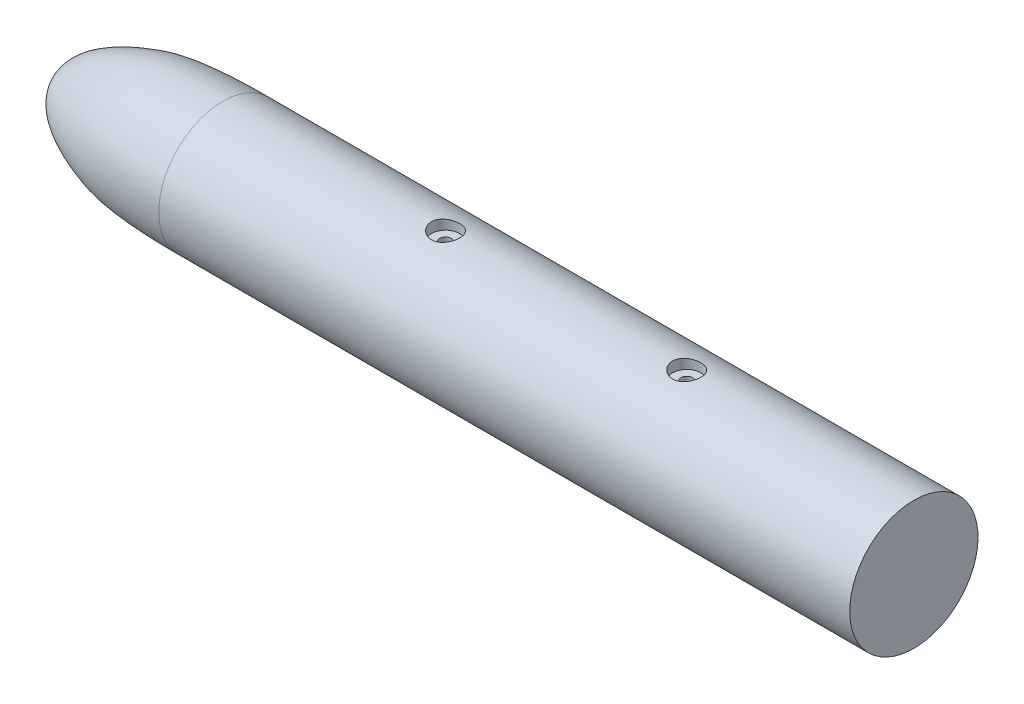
ISO-10303-21;
HEADER;
FILE_DESCRIPTION(('STEP AP214'),'2;1');
FILE_NAME('part.step','',(''),(''),'','','');
FILE_SCHEMA(('AUTOMOTIVE_DESIGN { 1 0 10303 214 1 1 1 1 }'));
ENDSEC;
DATA;
#1=APPLICATION_CONTEXT('core data for automotive mechanical design processes');
#2=APPLICATION_PROTOCOL_DEFINITION('international standard','automotive_design',2000,#1);
#3=PRODUCT_CONTEXT('',#1,'mechanical');
#4=PRODUCT('Part','Part','',(#3));
#5=PRODUCT_RELATED_PRODUCT_CATEGORY('part','',(#4));
#6=PRODUCT_DEFINITION_FORMATION('','',#4);
#7=PRODUCT_DEFINITION_CONTEXT('part definition',#1,'design');
#8=PRODUCT_DEFINITION('design','',#6,#7);
#9=PRODUCT_DEFINITION_SHAPE('','',#8);
#10=(LENGTH_UNIT() NAMED_UNIT(*) SI_UNIT(.MILLI.,.METRE.));
#11=(NAMED_UNIT(*) PLANE_ANGLE_UNIT() SI_UNIT($,.RADIAN.));
#12=(NAMED_UNIT(*) SI_UNIT($,.STERADIAN.) SOLID_ANGLE_UNIT());
#13=UNCERTAINTY_MEASURE_WITH_UNIT(LENGTH_MEASURE(1.E-05),#10,'distance_accuracy_value','');
#14=(GEOMETRIC_REPRESENTATION_CONTEXT(3) GLOBAL_UNCERTAINTY_ASSIGNED_CONTEXT((#13)) GLOBAL_UNIT_ASSIGNED_CONTEXT((#10,
#11,#12)) REPRESENTATION_CONTEXT('',''));
#15=CARTESIAN_POINT('',(0.,0.,0.));
#16=DIRECTION('',(0.,0.,1.));
#17=DIRECTION('',(1.,0.,0.));
#18=AXIS2_PLACEMENT_3D('',#15,#16,#17);
#19=CARTESIAN_POINT('',(164.275013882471,124.14471887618,0.));
#20=CARTESIAN_POINT('',(136.095574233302,124.14471887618,0.));
#21=CARTESIAN_POINT('',(107.837991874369,122.226315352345,0.));
#22=CARTESIAN_POINT('',(74.8345097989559,112.405956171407,0.));
#23=CARTESIAN_POINT('',(37.8142107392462,98.4388174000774,0.));
#24=CARTESIAN_POINT('',(37.8142107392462,74.1447188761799,0.));
#25=B_SPLINE_CURVE_WITH_KNOTS('',3,(#19,#20,#21,#22,#23,#24),.UNSPECIFIED.,.F.,.F.,(4,1,1,4),
(0.,0.389084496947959,0.472741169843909,1.),.UNSPECIFIED.);
#26=CARTESIAN_POINT('',(702.814210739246,74.14471887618,0.));
#27=DIRECTION('',(1.,0.,0.));
#28=AXIS1_PLACEMENT('',#26,#27);
#29=SURFACE_OF_REVOLUTION('',#25,#28);
#30=CARTESIAN_POINT('',(37.8142107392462,74.1447188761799,0.));
#31=VERTEX_POINT('',#30);
#32=VERTEX_LOOP('',#31);
#33=FACE_BOUND('',#32,.T.);
#34=CARTESIAN_POINT('',(164.275013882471,74.1447188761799,0.));
#35=DIRECTION('',(1.,0.,0.));
#36=DIRECTION('',(0.,1.,0.));
#37=AXIS2_PLACEMENT_3D('',#34,#35,#36);
#38=CIRCLE('',#37,50.);
#39=CARTESIAN_POINT('',(164.275013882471,124.14471887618,0.));
#40=VERTEX_POINT('',#39);
#41=EDGE_CURVE('E53',#40,#40,#38,.T.);
#42=ORIENTED_EDGE('',*,*,#41,.F.);
#43=EDGE_LOOP('',(#42));
#44=FACE_BOUND('',#43,.T.);
#45=ADVANCED_FACE('F35',(#33,#44),#29,.F.);
#46=CARTESIAN_POINT('',(702.814210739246,74.14471887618,0.));
#47=DIRECTION('',(1.,0.,0.));
#48=DIRECTION('',(0.,1.,0.));
#49=AXIS2_PLACEMENT_3D('',#46,#47,#48);
#50=CYLINDRICAL_SURFACE('',#49,50.);
#51=CARTESIAN_POINT('',(337.814210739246,24.710419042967,-7.50000000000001));
#52=CARTESIAN_POINT('',(338.023647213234,24.7104202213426,-7.50000285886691));
#53=CARTESIAN_POINT('',(338.233043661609,24.7090854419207,-7.49122436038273));
#54=CARTESIAN_POINT('',(338.650400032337,24.7037874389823,-7.45618073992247));
#55=CARTESIAN_POINT('',(338.858359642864,24.6998236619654,-7.42991193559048));
#56=CARTESIAN_POINT('',(339.271425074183,24.6893773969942,-7.36005702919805));
#57=CARTESIAN_POINT('',(339.476528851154,24.6828931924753,-7.31645912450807));
#58=CARTESIAN_POINT('',(339.882361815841,24.6675916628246,-7.21225725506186));
#59=CARTESIAN_POINT('',(340.083089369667,24.658773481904,-7.15164705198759));
#60=CARTESIAN_POINT('',(340.478449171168,24.6390704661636,-7.01395763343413));
#61=CARTESIAN_POINT('',(340.673088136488,24.6281880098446,-6.93689735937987));
#62=CARTESIAN_POINT('',(341.055228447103,24.6046562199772,-6.76679848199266));
#63=CARTESIAN_POINT('',(341.242727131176,24.5920062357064,-6.67375399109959));
#64=CARTESIAN_POINT('',(341.609123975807,24.5653078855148,-6.47242661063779));
#65=CARTESIAN_POINT('',(341.788026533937,24.5512602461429,-6.36415162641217));
#66=CARTESIAN_POINT('',(342.13617795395,24.522150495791,-6.13304743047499));
#67=CARTESIAN_POINT('',(342.305423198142,24.507088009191,-6.01021281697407));
#68=CARTESIAN_POINT('',(342.634151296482,24.4762695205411,-5.74999260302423));
#69=CARTESIAN_POINT('',(342.793560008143,24.460509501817,-5.61251380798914));
#70=CARTESIAN_POINT('',(343.100311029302,24.4288303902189,-5.32460397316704));
#71=CARTESIAN_POINT('',(343.24764885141,24.412911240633,-5.17416815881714));
#72=CARTESIAN_POINT('',(343.529128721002,24.3813716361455,-4.86147613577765));
#73=CARTESIAN_POINT('',(343.663274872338,24.3657510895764,-4.69922363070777));
#74=CARTESIAN_POINT('',(343.917533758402,24.3352357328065,-4.36391276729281));
#75=CARTESIAN_POINT('',(344.037641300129,24.3203411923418,-4.19085044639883));
#76=CARTESIAN_POINT('',(344.2634376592,24.2916354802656,-3.83434446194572));
#77=CARTESIAN_POINT('',(344.369057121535,24.2778296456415,-3.65085643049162));
#78=CARTESIAN_POINT('',(344.564450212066,24.251769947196,-3.27551999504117));
#79=CARTESIAN_POINT('',(344.654223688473,24.2395160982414,-3.08367151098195));
#80=CARTESIAN_POINT('',(344.817255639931,24.2169098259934,-2.69298404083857));
#81=CARTESIAN_POINT('',(344.890515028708,24.2065572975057,-2.49414544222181));
#82=CARTESIAN_POINT('',(345.019975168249,24.1880483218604,-2.09088597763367));
#83=CARTESIAN_POINT('',(345.07617565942,24.1798919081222,-1.88646502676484));
#84=CARTESIAN_POINT('',(345.170721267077,24.1660626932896,-1.47510875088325));
#85=CARTESIAN_POINT('',(345.209200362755,24.1603712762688,-1.26820484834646));
#86=CARTESIAN_POINT('',(345.268655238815,24.1515405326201,-0.851773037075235));
#87=CARTESIAN_POINT('',(345.289624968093,24.1484020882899,-0.642244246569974));
#88=CARTESIAN_POINT('',(345.31386619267,24.1447721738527,-0.222213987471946));
#89=CARTESIAN_POINT('',(345.317144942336,24.1442796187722,-0.0117129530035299));
#90=CARTESIAN_POINT('',(345.30601883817,24.1459466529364,0.408831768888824));
#91=CARTESIAN_POINT('',(345.291607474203,24.1481072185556,0.61887525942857));
#92=CARTESIAN_POINT('',(345.22229585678,24.1584490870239,1.24250876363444));
#93=CARTESIAN_POINT('',(345.14153536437,24.1704588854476,1.65347650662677));
#94=CARTESIAN_POINT('',(344.91305722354,24.2034424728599,2.45573109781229));
#95=CARTESIAN_POINT('',(344.765337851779,24.2244164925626,2.8470174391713));
#96=CARTESIAN_POINT('',(344.406555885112,24.2731095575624,3.60080086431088));
#97=CARTESIAN_POINT('',(344.195255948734,24.3008538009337,3.96318352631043));
#98=CARTESIAN_POINT('',(343.715484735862,24.3599968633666,4.64754437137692));
#99=CARTESIAN_POINT('',(343.44700969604,24.3913959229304,4.96951989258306));
#100=CARTESIAN_POINT('',(342.85736850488,24.4547109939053,5.56727109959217));
#101=CARTESIAN_POINT('',(342.535710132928,24.4866290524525,5.84256129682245));
#102=CARTESIAN_POINT('',(341.850505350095,24.5470836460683,6.33533031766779));
#103=CARTESIAN_POINT('',(341.486958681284,24.5756201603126,6.5528087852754));
#104=CARTESIAN_POINT('',(340.727790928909,24.6260801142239,6.92384813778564));
#105=CARTESIAN_POINT('',(340.332145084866,24.6479983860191,7.07735910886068));
#106=CARTESIAN_POINT('',(339.520284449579,24.6826487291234,7.31561681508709));
#107=CARTESIAN_POINT('',(339.104071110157,24.6953814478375,7.40036839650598));
#108=CARTESIAN_POINT('',(338.267210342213,24.7100963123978,7.49803607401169));
#109=CARTESIAN_POINT('',(337.846644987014,24.7121814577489,7.51164044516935));
#110=CARTESIAN_POINT('',(337.009239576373,24.7056384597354,7.46845256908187));
#111=CARTESIAN_POINT('',(336.592399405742,24.6970106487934,7.41166250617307));
#112=CARTESIAN_POINT('',(335.776412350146,24.6701088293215,7.22988620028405));
#113=CARTESIAN_POINT('',(335.377187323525,24.6518833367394,7.10524284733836));
#114=CARTESIAN_POINT('',(334.605287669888,24.6078785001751,6.79163767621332));
#115=CARTESIAN_POINT('',(334.232614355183,24.5820987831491,6.60267268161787));
#116=CARTESIAN_POINT('',(333.521354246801,24.5256521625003,6.16419864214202));
#117=CARTESIAN_POINT('',(333.18304523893,24.4949499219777,5.9142444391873));
#118=CARTESIAN_POINT('',(332.552809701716,24.4322068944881,5.36126562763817));
#119=CARTESIAN_POINT('',(332.26088579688,24.4001660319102,5.05823801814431));
#120=CARTESIAN_POINT('',(331.863005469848,24.3536631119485,4.5692491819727));
#121=CARTESIAN_POINT('',(331.736553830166,24.338354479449,4.39964273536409));
#122=CARTESIAN_POINT('',(331.498395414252,24.3087320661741,4.05031856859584));
#123=CARTESIAN_POINT('',(331.38668321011,24.294417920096,3.87060460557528));
#124=CARTESIAN_POINT('',(331.17877350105,24.2671849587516,3.50224772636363));
#125=CARTESIAN_POINT('',(331.082581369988,24.2542666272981,3.31360174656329));
#126=CARTESIAN_POINT('',(330.906480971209,24.2302007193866,2.92882425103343));
#127=CARTESIAN_POINT('',(330.826566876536,24.2190525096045,2.73269544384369));
#128=CARTESIAN_POINT('',(330.683830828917,24.1988748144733,2.33498699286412));
#129=CARTESIAN_POINT('',(330.620949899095,24.1898380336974,2.13342888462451));
#130=CARTESIAN_POINT('',(330.512385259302,24.1740898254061,1.72564776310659));
#131=CARTESIAN_POINT('',(330.466701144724,24.1673783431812,1.51942485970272));
#132=CARTESIAN_POINT('',(330.392879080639,24.1564719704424,1.10380369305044));
#133=CARTESIAN_POINT('',(330.364740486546,24.1522769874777,0.894405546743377));
#134=CARTESIAN_POINT('',(330.326224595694,24.1465231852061,0.473949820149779));
#135=CARTESIAN_POINT('',(330.31584689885,24.1449643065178,0.262892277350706));
#136=CARTESIAN_POINT('',(330.312946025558,24.1445291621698,-0.157311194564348));
#137=CARTESIAN_POINT('',(330.320251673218,24.1456271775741,-0.366455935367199));
#138=CARTESIAN_POINT('',(330.352299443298,24.1504205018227,-0.783301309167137));
#139=CARTESIAN_POINT('',(330.377035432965,24.154114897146,-0.991002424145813));
#140=CARTESIAN_POINT('',(330.443755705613,24.1639973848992,-1.40359226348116));
#141=CARTESIAN_POINT('',(330.485743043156,24.1701859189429,-1.60848048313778));
#142=CARTESIAN_POINT('',(330.586649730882,24.1848835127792,-2.01395355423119));
#143=CARTESIAN_POINT('',(330.645568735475,24.1933925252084,-2.21453849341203));
#144=CARTESIAN_POINT('',(330.779853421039,24.2124870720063,-2.60985890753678));
#145=CARTESIAN_POINT('',(330.855207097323,24.2230710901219,-2.80459853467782));
#146=CARTESIAN_POINT('',(331.021836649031,24.2460261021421,-3.18702983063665));
#147=CARTESIAN_POINT('',(331.113112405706,24.2583970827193,-3.37472155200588));
#148=CARTESIAN_POINT('',(331.310953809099,24.2845871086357,-3.74180864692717));
#149=CARTESIAN_POINT('',(331.417522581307,24.2984064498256,-3.92120231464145));
#150=CARTESIAN_POINT('',(331.645145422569,24.3271052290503,-4.27036894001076));
#151=CARTESIAN_POINT('',(331.766194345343,24.341984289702,-4.44014528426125));
#152=CARTESIAN_POINT('',(332.023215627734,24.3725460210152,-4.77059902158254));
#153=CARTESIAN_POINT('',(332.159321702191,24.388235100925,-4.93117183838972));
#154=CARTESIAN_POINT('',(332.444479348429,24.4198362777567,-5.2402461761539));
#155=CARTESIAN_POINT('',(332.593526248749,24.4357482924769,-5.38875201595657));
#156=CARTESIAN_POINT('',(332.903672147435,24.4673640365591,-5.67281744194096));
#157=CARTESIAN_POINT('',(333.064778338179,24.4830676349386,-5.80836919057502));
#158=CARTESIAN_POINT('',(333.397791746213,24.5138083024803,-6.0654325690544));
#159=CARTESIAN_POINT('',(333.569694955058,24.5288456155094,-6.18694936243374));
#160=CARTESIAN_POINT('',(333.924234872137,24.557921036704,-6.41582997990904));
#161=CARTESIAN_POINT('',(334.106929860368,24.5719525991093,-6.52310439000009));
#162=CARTESIAN_POINT('',(334.480754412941,24.5985062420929,-6.7218199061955));
#163=CARTESIAN_POINT('',(334.671880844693,24.611028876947,-6.81326683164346));
#164=CARTESIAN_POINT('',(335.061143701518,24.634198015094,-6.97964058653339));
#165=CARTESIAN_POINT('',(335.259274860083,24.6448458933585,-7.05457953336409));
#166=CARTESIAN_POINT('',(335.661194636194,24.6639633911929,-7.18744237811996));
#167=CARTESIAN_POINT('',(335.864981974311,24.6724334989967,-7.24537009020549));
#168=CARTESIAN_POINT('',(336.3559754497,24.68973476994,-7.36270195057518));
#169=CARTESIAN_POINT('',(336.64516447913,24.6974555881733,-7.41413110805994));
#170=CARTESIAN_POINT('',(337.227665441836,24.7077968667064,-7.48277790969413));
#171=CARTESIAN_POINT('',(337.520977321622,24.7104173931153,-7.4999959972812));
#172=CARTESIAN_POINT('',(337.814210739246,24.710419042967,-7.50000000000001));
#173=B_SPLINE_CURVE_WITH_KNOTS('',3,(#51,#52,#53,#54,#55,#56,#57,#58,#59,#60,#61,#62,#63,#64,
#65,#66,#67,#68,#69,#70,#71,#72,#73,#74,#75,#76,#77,#78,#79,#80,#81,#82,#83,#84,#85,#86,#87,#88,
#89,#90,#91,#92,#93,#94,#95,#96,#97,#98,#99,#100,#101,#102,#103,#104,#105,#106,#107,#108,#109,
#110,#111,#112,#113,#114,#115,#116,#117,#118,#119,#120,#121,#122,#123,#124,#125,#126,#127,#128,
#129,#130,#131,#132,#133,#134,#135,#136,#137,#138,#139,#140,#141,#142,#143,#144,#145,#146,#147,
#148,#149,#150,#151,#152,#153,#154,#155,#156,#157,#158,#159,#160,#161,#162,#163,#164,#165,#166,
#167,#168,#169,#170,#171,#172),.UNSPECIFIED.,.T.,.F.,(4,2,2,2,2,2,2,2,2,2,2,2,2,2,2,2,2,2,2,2,2,
2,2,2,2,2,2,2,2,2,2,2,2,2,2,2,2,2,2,2,2,2,2,2,2,2,2,2,2,2,2,2,2,2,2,2,2,2,2,2,4),(0.,
0.628052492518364,1.25623725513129,1.88485060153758,2.51369475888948,3.1418187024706,
3.77017450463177,4.39820535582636,5.02646994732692,5.65900321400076,6.291770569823,
6.92434044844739,7.55714358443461,8.1928774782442,8.82861746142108,9.46432226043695,
10.100036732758,10.7308627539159,11.3619066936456,11.9926918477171,12.6237092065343,
13.874249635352,15.1248222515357,16.3801223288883,17.6355050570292,18.9032337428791,
20.1709702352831,21.4396940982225,22.7083285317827,23.9646672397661,25.220966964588,
26.4709762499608,27.721047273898,28.9805308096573,30.2400855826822,30.8757939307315,
31.5112675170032,32.1469606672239,32.7824258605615,33.4156618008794,34.048882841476,
34.6820806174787,35.3152641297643,35.9423429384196,36.5692012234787,37.196170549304,
37.8231270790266,38.4496271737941,39.0761225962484,39.7027462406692,40.3291478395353,
40.961642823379,41.5939104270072,42.2265581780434,42.8589724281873,43.4951860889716,
44.1311653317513,44.7666761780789,45.4020444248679,46.2813963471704,47.1607368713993),.UNSPECIFIED.);
#174=CARTESIAN_POINT('',(337.814210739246,24.710419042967,-7.50000000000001));
#175=VERTEX_POINT('',#174);
#176=EDGE_CURVE('E11',#175,#175,#173,.T.);
#177=ORIENTED_EDGE('',*,*,#176,.F.);
#178=EDGE_LOOP('',(#177));
#179=FACE_BOUND('',#178,.T.);
#180=CARTESIAN_POINT('',(525.814210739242,24.710419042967,-7.49999999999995));
#181=CARTESIAN_POINT('',(526.023647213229,24.7104202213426,-7.50000285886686));
#182=CARTESIAN_POINT('',(526.233043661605,24.7090854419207,-7.49122436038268));
#183=CARTESIAN_POINT('',(526.650400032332,24.7037874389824,-7.45618073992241));
#184=CARTESIAN_POINT('',(526.85835964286,24.6998236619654,-7.42991193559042));
#185=CARTESIAN_POINT('',(527.271425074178,24.6893773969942,-7.36005702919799));
#186=CARTESIAN_POINT('',(527.476528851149,24.6828931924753,-7.31645912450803));
#187=CARTESIAN_POINT('',(527.882361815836,24.6675916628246,-7.21225725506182));
#188=CARTESIAN_POINT('',(528.083089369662,24.658773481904,-7.15164705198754));
#189=CARTESIAN_POINT('',(528.478449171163,24.6390704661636,-7.01395763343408));
#190=CARTESIAN_POINT('',(528.673088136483,24.6281880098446,-6.93689735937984));
#191=CARTESIAN_POINT('',(529.055228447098,24.6046562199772,-6.76679848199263));
#192=CARTESIAN_POINT('',(529.242727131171,24.5920062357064,-6.67375399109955));
#193=CARTESIAN_POINT('',(529.609123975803,24.5653078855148,-6.47242661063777));
#194=CARTESIAN_POINT('',(529.788026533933,24.551260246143,-6.36415162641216));
#195=CARTESIAN_POINT('',(530.136177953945,24.522150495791,-6.13304743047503));
#196=CARTESIAN_POINT('',(530.305423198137,24.507088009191,-6.01021281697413));
#197=CARTESIAN_POINT('',(530.634151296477,24.4762695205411,-5.74999260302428));
#198=CARTESIAN_POINT('',(530.793560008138,24.460509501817,-5.61251380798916));
#199=CARTESIAN_POINT('',(531.100311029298,24.4288303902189,-5.32460397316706));
#200=CARTESIAN_POINT('',(531.247648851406,24.412911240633,-5.17416815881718));
#201=CARTESIAN_POINT('',(531.529128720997,24.3813716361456,-4.86147613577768));
#202=CARTESIAN_POINT('',(531.663274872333,24.3657510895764,-4.69922363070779));
#203=CARTESIAN_POINT('',(531.917533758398,24.3352357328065,-4.36391276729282));
#204=CARTESIAN_POINT('',(532.037641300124,24.3203411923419,-4.19085044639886));
#205=CARTESIAN_POINT('',(532.263437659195,24.2916354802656,-3.83434446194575));
#206=CARTESIAN_POINT('',(532.369057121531,24.2778296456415,-3.65085643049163));
#207=CARTESIAN_POINT('',(532.564450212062,24.251769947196,-3.27551999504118));
#208=CARTESIAN_POINT('',(532.654223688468,24.2395160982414,-3.08367151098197));
#209=CARTESIAN_POINT('',(532.817255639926,24.2169098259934,-2.69298404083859));
#210=CARTESIAN_POINT('',(532.890515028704,24.2065572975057,-2.49414544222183));
#211=CARTESIAN_POINT('',(533.019975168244,24.1880483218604,-2.09088597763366));
#212=CARTESIAN_POINT('',(533.076175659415,24.1798919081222,-1.88646502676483));
#213=CARTESIAN_POINT('',(533.170721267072,24.1660626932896,-1.47510875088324));
#214=CARTESIAN_POINT('',(533.20920036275,24.1603712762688,-1.26820484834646));
#215=CARTESIAN_POINT('',(533.26865523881,24.1515405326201,-0.851773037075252));
#216=CARTESIAN_POINT('',(533.289624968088,24.1484020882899,-0.64224424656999));
#217=CARTESIAN_POINT('',(533.313866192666,24.1447721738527,-0.222213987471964));
#218=CARTESIAN_POINT('',(533.317144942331,24.1442796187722,-0.0117129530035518));
#219=CARTESIAN_POINT('',(533.306018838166,24.1459466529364,0.408831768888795));
#220=CARTESIAN_POINT('',(533.291607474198,24.1481072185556,0.618875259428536));
#221=CARTESIAN_POINT('',(533.222295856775,24.1584490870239,1.24250876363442));
#222=CARTESIAN_POINT('',(533.141535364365,24.1704588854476,1.65347650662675));
#223=CARTESIAN_POINT('',(532.913057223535,24.2034424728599,2.45573109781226));
#224=CARTESIAN_POINT('',(532.765337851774,24.2244164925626,2.84701743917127));
#225=CARTESIAN_POINT('',(532.406555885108,24.2731095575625,3.60080086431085));
#226=CARTESIAN_POINT('',(532.195255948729,24.3008538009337,3.9631835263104));
#227=CARTESIAN_POINT('',(531.715484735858,24.3599968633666,4.64754437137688));
#228=CARTESIAN_POINT('',(531.447009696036,24.3913959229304,4.969519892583));
#229=CARTESIAN_POINT('',(530.857368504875,24.4547109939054,5.56727109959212));
#230=CARTESIAN_POINT('',(530.535710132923,24.4866290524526,5.84256129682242));
#231=CARTESIAN_POINT('',(529.850505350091,24.5470836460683,6.33533031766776));
#232=CARTESIAN_POINT('',(529.48695868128,24.5756201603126,6.55280878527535));
#233=CARTESIAN_POINT('',(528.727790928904,24.6260801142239,6.92384813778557));
#234=CARTESIAN_POINT('',(528.332145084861,24.6479983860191,7.07735910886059));
#235=CARTESIAN_POINT('',(527.520284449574,24.6826487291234,7.315616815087));
#236=CARTESIAN_POINT('',(527.104071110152,24.6953814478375,7.40036839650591));
#237=CARTESIAN_POINT('',(526.267210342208,24.7100963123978,7.49803607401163));
#238=CARTESIAN_POINT('',(525.84664498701,24.7121814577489,7.5116404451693));
#239=CARTESIAN_POINT('',(525.009239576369,24.7056384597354,7.46845256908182));
#240=CARTESIAN_POINT('',(524.592399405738,24.6970106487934,7.41166250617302));
#241=CARTESIAN_POINT('',(523.776412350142,24.6701088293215,7.22988620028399));
#242=CARTESIAN_POINT('',(523.37718732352,24.6518833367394,7.10524284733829));
#243=CARTESIAN_POINT('',(522.605287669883,24.6078785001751,6.79163767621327));
#244=CARTESIAN_POINT('',(522.232614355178,24.5820987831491,6.60267268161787));
#245=CARTESIAN_POINT('',(521.521354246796,24.5256521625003,6.16419864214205));
#246=CARTESIAN_POINT('',(521.183045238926,24.4949499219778,5.91424443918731));
#247=CARTESIAN_POINT('',(520.552809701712,24.4322068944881,5.36126562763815));
#248=CARTESIAN_POINT('',(520.260885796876,24.4001660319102,5.05823801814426));
#249=CARTESIAN_POINT('',(519.863005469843,24.3536631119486,4.56924918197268));
#250=CARTESIAN_POINT('',(519.736553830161,24.338354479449,4.39964273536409));
#251=CARTESIAN_POINT('',(519.498395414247,24.3087320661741,4.05031856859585));
#252=CARTESIAN_POINT('',(519.386683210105,24.294417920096,3.87060460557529));
#253=CARTESIAN_POINT('',(519.178773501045,24.2671849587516,3.50224772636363));
#254=CARTESIAN_POINT('',(519.082581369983,24.2542666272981,3.31360174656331));
#255=CARTESIAN_POINT('',(518.906480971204,24.2302007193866,2.92882425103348));
#256=CARTESIAN_POINT('',(518.826566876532,24.2190525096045,2.73269544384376));
#257=CARTESIAN_POINT('',(518.683830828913,24.1988748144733,2.33498699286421));
#258=CARTESIAN_POINT('',(518.62094989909,24.1898380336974,2.13342888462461));
#259=CARTESIAN_POINT('',(518.512385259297,24.1740898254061,1.72564776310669));
#260=CARTESIAN_POINT('',(518.46670114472,24.1673783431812,1.51942485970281));
#261=CARTESIAN_POINT('',(518.392879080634,24.1564719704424,1.10380369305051));
#262=CARTESIAN_POINT('',(518.364740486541,24.1522769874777,0.894405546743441));
#263=CARTESIAN_POINT('',(518.326224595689,24.1465231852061,0.473949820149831));
#264=CARTESIAN_POINT('',(518.315846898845,24.1449643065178,0.262892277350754));
#265=CARTESIAN_POINT('',(518.312946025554,24.1445291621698,-0.157311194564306));
#266=CARTESIAN_POINT('',(518.320251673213,24.1456271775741,-0.366455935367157));
#267=CARTESIAN_POINT('',(518.352299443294,24.1504205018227,-0.783301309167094));
#268=CARTESIAN_POINT('',(518.37703543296,24.1541148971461,-0.991002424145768));
#269=CARTESIAN_POINT('',(518.443755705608,24.1639973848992,-1.40359226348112));
#270=CARTESIAN_POINT('',(518.485743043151,24.1701859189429,-1.60848048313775));
#271=CARTESIAN_POINT('',(518.586649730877,24.1848835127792,-2.01395355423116));
#272=CARTESIAN_POINT('',(518.64556873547,24.1933925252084,-2.214538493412));
#273=CARTESIAN_POINT('',(518.779853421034,24.2124870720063,-2.60985890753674));
#274=CARTESIAN_POINT('',(518.855207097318,24.2230710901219,-2.80459853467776));
#275=CARTESIAN_POINT('',(519.021836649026,24.2460261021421,-3.18702983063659));
#276=CARTESIAN_POINT('',(519.113112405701,24.2583970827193,-3.37472155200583));
#277=CARTESIAN_POINT('',(519.310953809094,24.2845871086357,-3.74180864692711));
#278=CARTESIAN_POINT('',(519.417522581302,24.2984064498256,-3.92120231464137));
#279=CARTESIAN_POINT('',(519.645145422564,24.3271052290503,-4.27036894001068));
#280=CARTESIAN_POINT('',(519.766194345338,24.341984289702,-4.44014528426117));
#281=CARTESIAN_POINT('',(520.023215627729,24.3725460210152,-4.77059902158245));
#282=CARTESIAN_POINT('',(520.159321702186,24.388235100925,-4.93117183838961));
#283=CARTESIAN_POINT('',(520.444479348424,24.4198362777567,-5.24024617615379));
#284=CARTESIAN_POINT('',(520.593526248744,24.4357482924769,-5.38875201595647));
#285=CARTESIAN_POINT('',(520.903672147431,24.4673640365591,-5.67281744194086));
#286=CARTESIAN_POINT('',(521.064778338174,24.4830676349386,-5.80836919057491));
#287=CARTESIAN_POINT('',(521.397791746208,24.5138083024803,-6.06543256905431));
#288=CARTESIAN_POINT('',(521.569694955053,24.5288456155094,-6.18694936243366));
#289=CARTESIAN_POINT('',(521.924234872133,24.557921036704,-6.41582997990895));
#290=CARTESIAN_POINT('',(522.106929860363,24.5719525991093,-6.52310438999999));
#291=CARTESIAN_POINT('',(522.480754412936,24.5985062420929,-6.72181990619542));
#292=CARTESIAN_POINT('',(522.671880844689,24.611028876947,-6.81326683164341));
#293=CARTESIAN_POINT('',(523.061143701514,24.634198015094,-6.97964058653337));
#294=CARTESIAN_POINT('',(523.259274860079,24.6448458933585,-7.05457953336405));
#295=CARTESIAN_POINT('',(523.66119463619,24.6639633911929,-7.18744237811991));
#296=CARTESIAN_POINT('',(523.864981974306,24.6724334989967,-7.24537009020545));
#297=CARTESIAN_POINT('',(524.355975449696,24.68973476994,-7.36270195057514));
#298=CARTESIAN_POINT('',(524.645164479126,24.6974555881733,-7.41413110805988));
#299=CARTESIAN_POINT('',(525.227665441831,24.7077968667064,-7.48277790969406));
#300=CARTESIAN_POINT('',(525.520977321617,24.7104173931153,-7.49999599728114));
#301=CARTESIAN_POINT('',(525.814210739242,24.710419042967,-7.49999999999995));
#302=B_SPLINE_CURVE_WITH_KNOTS('',3,(#180,#181,#182,#183,#184,#185,#186,#187,#188,#189,#190,
#191,#192,#193,#194,#195,#196,#197,#198,#199,#200,#201,#202,#203,#204,#205,#206,#207,#208,#209,
#210,#211,#212,#213,#214,#215,#216,#217,#218,#219,#220,#221,#222,#223,#224,#225,#226,#227,#228,
#229,#230,#231,#232,#233,#234,#235,#236,#237,#238,#239,#240,#241,#242,#243,#244,#245,#246,#247,
#248,#249,#250,#251,#252,#253,#254,#255,#256,#257,#258,#259,#260,#261,#262,#263,#264,#265,#266,
#267,#268,#269,#270,#271,#272,#273,#274,#275,#276,#277,#278,#279,#280,#281,#282,#283,#284,#285,
#286,#287,#288,#289,#290,#291,#292,#293,#294,#295,#296,#297,#298,#299,#300,#301),.UNSPECIFIED.,
.T.,.F.,(4,2,2,2,2,2,2,2,2,2,2,2,2,2,2,2,2,2,2,2,2,2,2,2,2,2,2,2,2,2,2,2,2,2,2,2,2,2,2,2,2,2,2,
2,2,2,2,2,2,2,2,2,2,2,2,2,2,2,2,2,4),(0.,0.628052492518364,1.25623725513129,1.88485060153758,
2.51369475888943,3.14181870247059,3.77017450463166,4.39820535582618,5.02646994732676,
5.65900321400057,6.2917705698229,6.92434044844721,7.55714358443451,8.19287747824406,
8.82861746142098,9.46432226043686,10.1000367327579,10.7308627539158,11.3619066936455,
11.992691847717,12.6237092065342,13.8742496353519,15.1248222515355,16.3801223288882,
17.6355050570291,18.903233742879,20.1709702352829,21.4396940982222,22.7083285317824,
23.9646672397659,25.2209669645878,26.4709762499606,27.7210472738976,28.980530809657,
30.2400855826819,30.8757939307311,31.5112675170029,32.1469606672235,32.7824258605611,
33.415661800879,34.0488828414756,34.6820806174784,35.3152641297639,35.9423429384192,
36.5692012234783,37.1961705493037,37.8231270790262,38.4496271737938,39.076122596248,
39.7027462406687,40.3291478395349,40.9616428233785,41.5939104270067,42.2265581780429,
42.8589724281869,43.4951860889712,44.1311653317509,44.7666761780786,45.4020444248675,
46.28139634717,47.1607368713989),.UNSPECIFIED.);
#303=CARTESIAN_POINT('',(525.814210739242,24.710419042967,-7.49999999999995));
#304=VERTEX_POINT('',#303);
#305=EDGE_CURVE('E45',#304,#304,#302,.T.);
#306=ORIENTED_EDGE('',*,*,#305,.F.);
#307=EDGE_LOOP('',(#306));
#308=FACE_BOUND('',#307,.T.);
#309=CARTESIAN_POINT('',(514.814210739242,124.14471887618,0.));
#310=CARTESIAN_POINT('',(514.814203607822,124.144722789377,0.305100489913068));
#311=CARTESIAN_POINT('',(514.826907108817,124.14192170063,0.610116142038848));
#312=CARTESIAN_POINT('',(514.877602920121,124.130804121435,1.21802683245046));
#313=CARTESIAN_POINT('',(514.915598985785,124.122486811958,1.5209215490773));
#314=CARTESIAN_POINT('',(515.016612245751,124.100556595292,2.12249182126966));
#315=CARTESIAN_POINT('',(515.079644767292,124.086940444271,2.42116467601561));
#316=CARTESIAN_POINT('',(515.230223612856,124.054791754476,3.01200141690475));
#317=CARTESIAN_POINT('',(515.317770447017,124.03625911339,3.30416516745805));
#318=CARTESIAN_POINT('',(515.516585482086,123.994810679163,3.87962478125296));
#319=CARTESIAN_POINT('',(515.627827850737,123.971899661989,4.1629299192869));
#320=CARTESIAN_POINT('',(515.873251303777,123.922306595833,4.7190794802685));
#321=CARTESIAN_POINT('',(516.007432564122,123.895624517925,4.99192382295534));
#322=CARTESIAN_POINT('',(516.297725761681,123.839217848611,5.52527642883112));
#323=CARTESIAN_POINT('',(516.453833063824,123.809493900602,5.78578728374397));
#324=CARTESIAN_POINT('',(516.786957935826,123.747788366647,6.29291485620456));
#325=CARTESIAN_POINT('',(516.963982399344,123.715806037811,6.53952695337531));
#326=CARTESIAN_POINT('',(517.340388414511,123.64997967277,7.02060901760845));
#327=CARTESIAN_POINT('',(517.540054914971,123.616115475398,7.25485331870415));
#328=CARTESIAN_POINT('',(517.958266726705,123.547889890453,7.70575760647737));
#329=CARTESIAN_POINT('',(518.176812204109,123.513528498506,7.9224174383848));
#330=CARTESIAN_POINT('',(518.631381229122,123.44525180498,8.33675968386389));
#331=CARTESIAN_POINT('',(518.867409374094,123.41133662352,8.53443707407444));
#332=CARTESIAN_POINT('',(519.355240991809,123.344921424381,8.90933834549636));
#333=CARTESIAN_POINT('',(519.60703892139,123.31242091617,9.08656935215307));
#334=CARTESIAN_POINT('',(520.127768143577,123.249383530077,9.42131946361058));
#335=CARTESIAN_POINT('',(520.396862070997,123.2188732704,9.57859074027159));
#336=CARTESIAN_POINT('',(520.947705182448,123.161122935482,9.86986272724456));
#337=CARTESIAN_POINT('',(521.229454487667,123.133882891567,10.0038632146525));
#338=CARTESIAN_POINT('',(521.803604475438,123.08348885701,10.2475501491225));
#339=CARTESIAN_POINT('',(522.096004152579,123.060334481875,10.3572388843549));
#340=CARTESIAN_POINT('',(522.689378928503,123.018812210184,10.5514393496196));
#341=CARTESIAN_POINT('',(522.99035387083,123.000444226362,10.6359515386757));
#342=CARTESIAN_POINT('',(523.593883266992,122.969307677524,10.7779745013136));
#343=CARTESIAN_POINT('',(523.896338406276,122.956455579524,10.8358890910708));
#344=CARTESIAN_POINT('',(524.505221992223,122.936325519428,10.9261734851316));
#345=CARTESIAN_POINT('',(524.811650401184,122.929047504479,10.9585435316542));
#346=CARTESIAN_POINT('',(525.42619185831,122.920288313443,10.9974645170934));
#347=CARTESIAN_POINT('',(525.734304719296,122.918806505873,11.0040182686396));
#348=CARTESIAN_POINT('',(526.349965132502,122.921683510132,10.9912585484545));
#349=CARTESIAN_POINT('',(526.657512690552,122.926042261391,10.9719453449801));
#350=CARTESIAN_POINT('',(527.264110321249,122.940333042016,10.9082113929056));
#351=CARTESIAN_POINT('',(527.563212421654,122.950160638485,10.8642610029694));
#352=CARTESIAN_POINT('',(528.156572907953,122.975024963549,10.751953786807));
#353=CARTESIAN_POINT('',(528.450831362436,122.990061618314,10.6835973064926));
#354=CARTESIAN_POINT('',(529.032479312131,123.02490876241,10.5230118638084));
#355=CARTESIAN_POINT('',(529.319868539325,123.044719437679,10.4307819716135));
#356=CARTESIAN_POINT('',(529.885819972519,123.088547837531,10.223152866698));
#357=CARTESIAN_POINT('',(530.164382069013,123.112565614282,10.107753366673));
#358=CARTESIAN_POINT('',(530.713025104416,123.164339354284,9.85361606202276));
#359=CARTESIAN_POINT('',(530.983019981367,123.192123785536,9.71469829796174));
#360=CARTESIAN_POINT('',(531.510379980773,123.250499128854,9.41517997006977));
#361=CARTESIAN_POINT('',(531.767745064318,123.281090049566,9.25457933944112));
#362=CARTESIAN_POINT('',(532.268202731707,123.344234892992,8.9127895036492));
#363=CARTESIAN_POINT('',(532.511293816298,123.376789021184,8.731598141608));
#364=CARTESIAN_POINT('',(532.9816178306,123.442969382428,8.34985122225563));
#365=CARTESIAN_POINT('',(533.208850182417,123.476595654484,8.14929495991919));
#366=CARTESIAN_POINT('',(533.650775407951,123.54474958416,7.72554252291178));
#367=CARTESIAN_POINT('',(533.865084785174,123.579280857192,7.50194678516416));
#368=CARTESIAN_POINT('',(534.274150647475,123.647546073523,7.03741436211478));
#369=CARTESIAN_POINT('',(534.468906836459,123.681280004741,6.79647741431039));
#370=CARTESIAN_POINT('',(534.837518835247,123.747009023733,6.29887167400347));
#371=CARTESIAN_POINT('',(535.011373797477,123.779004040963,6.04220224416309));
#372=CARTESIAN_POINT('',(535.336923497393,123.840357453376,5.51488430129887));
#373=CARTESIAN_POINT('',(535.488619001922,123.869715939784,5.24423627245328));
#374=CARTESIAN_POINT('',(535.769043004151,123.925033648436,4.69019460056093));
#375=CARTESIAN_POINT('',(535.897719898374,123.950985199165,4.40677406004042));
#376=CARTESIAN_POINT('',(536.130698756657,123.998674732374,3.82973704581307));
#377=CARTESIAN_POINT('',(536.235000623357,124.020412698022,3.5361205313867));
#378=CARTESIAN_POINT('',(536.418382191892,124.059049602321,2.94083869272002));
#379=CARTESIAN_POINT('',(536.497464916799,124.075949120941,2.6391743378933));
#380=CARTESIAN_POINT('',(536.629770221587,124.104424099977,2.02998096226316));
#381=CARTESIAN_POINT('',(536.682993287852,124.115999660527,1.72245205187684));
#382=CARTESIAN_POINT('',(536.762325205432,124.133315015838,1.11004574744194));
#383=CARTESIAN_POINT('',(536.788957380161,124.139167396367,0.805239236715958));
#384=CARTESIAN_POINT('',(536.816740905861,124.145273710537,0.194412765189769));
#385=CARTESIAN_POINT('',(536.817892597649,124.14552771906,-0.11160717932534));
#386=CARTESIAN_POINT('',(536.794706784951,124.140430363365,-0.722612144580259));
#387=CARTESIAN_POINT('',(536.770370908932,124.135079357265,-1.02759723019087));
#388=CARTESIAN_POINT('',(536.696413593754,124.118922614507,-1.63433823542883));
#389=CARTESIAN_POINT('',(536.64679222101,124.108116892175,-1.93609416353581));
#390=CARTESIAN_POINT('',(536.52336075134,124.081502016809,-2.53087524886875));
#391=CARTESIAN_POINT('',(536.44982616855,124.065749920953,-2.82396021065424));
#392=CARTESIAN_POINT('',(536.279001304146,124.02963521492,-3.40282602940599));
#393=CARTESIAN_POINT('',(536.181711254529,124.009272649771,-3.68860695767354));
#394=CARTESIAN_POINT('',(535.964121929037,123.964487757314,-4.25090290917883));
#395=CARTESIAN_POINT('',(535.843825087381,123.940065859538,-4.52741890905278));
#396=CARTESIAN_POINT('',(535.581048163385,123.88780418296,-5.06948148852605));
#397=CARTESIAN_POINT('',(535.438560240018,123.859963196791,-5.33502414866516));
#398=CARTESIAN_POINT('',(535.130254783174,123.80119338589,-5.85700474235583));
#399=CARTESIAN_POINT('',(534.964134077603,123.770226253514,-6.11325930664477));
#400=CARTESIAN_POINT('',(534.611297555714,123.706383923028,-6.61092343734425));
#401=CARTESIAN_POINT('',(534.424581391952,123.673508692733,-6.85233275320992));
#402=CARTESIAN_POINT('',(534.031766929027,123.606732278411,-7.31879557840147));
#403=CARTESIAN_POINT('',(533.825663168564,123.572830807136,-7.54384444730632));
#404=CARTESIAN_POINT('',(533.395558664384,123.504943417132,-7.97596795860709));
#405=CARTESIAN_POINT('',(533.17156389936,123.47095753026,-8.18304855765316));
#406=CARTESIAN_POINT('',(532.702695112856,123.403184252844,-8.58168066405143));
#407=CARTESIAN_POINT('',(532.457506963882,123.369412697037,-8.77286559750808));
#408=CARTESIAN_POINT('',(531.951662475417,123.303700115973,-9.13390634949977));
#409=CARTESIAN_POINT('',(531.691005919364,123.271759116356,-9.30376186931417));
#410=CARTESIAN_POINT('',(531.15600696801,123.210635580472,-9.62091003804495));
#411=CARTESIAN_POINT('',(530.881664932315,123.181452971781,-9.76820327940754));
#412=CARTESIAN_POINT('',(530.321187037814,123.126706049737,-10.0391256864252));
#413=CARTESIAN_POINT('',(530.035051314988,123.101141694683,-10.1627551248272));
#414=CARTESIAN_POINT('',(529.454668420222,123.054531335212,-10.3847506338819));
#415=CARTESIAN_POINT('',(529.160476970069,123.033460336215,-10.4832570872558));
#416=CARTESIAN_POINT('',(528.564530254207,122.996288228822,-10.6551355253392));
#417=CARTESIAN_POINT('',(528.26277500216,122.98018711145,-10.7285075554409));
#418=CARTESIAN_POINT('',(527.653947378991,122.953449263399,-10.8495015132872));
#419=CARTESIAN_POINT('',(527.346875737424,122.942811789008,-10.8971269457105));
#420=CARTESIAN_POINT('',(526.729661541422,122.927327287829,-10.9662380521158));
#421=CARTESIAN_POINT('',(526.419519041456,122.922480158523,-10.987724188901));
#422=CARTESIAN_POINT('',(525.805361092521,122.918768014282,-11.0041898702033));
#423=CARTESIAN_POINT('',(525.501361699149,122.919773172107,-10.9997446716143));
#424=CARTESIAN_POINT('',(524.894848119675,122.927433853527,-10.9657203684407));
#425=CARTESIAN_POINT('',(524.592333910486,122.934089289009,-10.9361416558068));
#426=CARTESIAN_POINT('',(523.990962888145,122.952852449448,-10.8520940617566));
#427=CARTESIAN_POINT('',(523.692106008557,122.964960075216,-10.7976256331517));
#428=CARTESIAN_POINT('',(523.100156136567,122.994270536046,-10.6642373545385));
#429=CARTESIAN_POINT('',(522.807063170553,123.011473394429,-10.5853173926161));
#430=CARTESIAN_POINT('',(522.22971428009,123.050403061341,-10.4039710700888));
#431=CARTESIAN_POINT('',(521.945430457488,123.072113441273,-10.3016299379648));
#432=CARTESIAN_POINT('',(521.386523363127,123.119476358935,-10.074057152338));
#433=CARTESIAN_POINT('',(521.111900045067,123.145128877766,-9.9488256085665));
#434=CARTESIAN_POINT('',(520.574148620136,123.19965435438,-9.67639344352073));
#435=CARTESIAN_POINT('',(520.311019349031,123.22852698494,-9.52919505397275));
#436=CARTESIAN_POINT('',(519.797828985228,123.28871011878,-9.21378855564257));
#437=CARTESIAN_POINT('',(519.547772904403,123.320021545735,-9.04557247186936));
#438=CARTESIAN_POINT('',(519.05756254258,123.384865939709,-8.6857350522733));
#439=CARTESIAN_POINT('',(518.81770709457,123.418430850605,-8.49371224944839));
#440=CARTESIAN_POINT('',(518.354842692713,123.486280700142,-8.09024908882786));
#441=CARTESIAN_POINT('',(518.131841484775,123.520565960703,-7.87879990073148));
#442=CARTESIAN_POINT('',(517.704237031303,123.588900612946,-7.43791984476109));
#443=CARTESIAN_POINT('',(517.499638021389,123.62294994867,-7.2084848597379));
#444=CARTESIAN_POINT('',(517.110365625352,123.689851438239,-6.73330320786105));
#445=CARTESIAN_POINT('',(516.925683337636,123.722704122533,-6.48756390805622));
#446=CARTESIAN_POINT('',(516.575043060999,123.786758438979,-5.97785579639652));
#447=CARTESIAN_POINT('',(516.409374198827,123.817931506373,-5.7136843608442));
#448=CARTESIAN_POINT('',(516.100987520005,123.877241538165,-5.17207656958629));
#449=CARTESIAN_POINT('',(515.958261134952,123.905379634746,-4.89464521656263));
#450=CARTESIAN_POINT('',(515.696838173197,123.957817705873,-4.3284996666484));
#451=CARTESIAN_POINT('',(515.578128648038,123.982119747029,-4.03979165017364));
#452=CARTESIAN_POINT('',(515.365605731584,124.02620428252,-3.45311964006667));
#453=CARTESIAN_POINT('',(515.271787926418,124.045987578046,-3.15515729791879));
#454=CARTESIAN_POINT('',(515.066139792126,124.089747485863,-2.38947918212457));
#455=CARTESIAN_POINT('',(514.971807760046,124.110246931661,-1.91674140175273));
#456=CARTESIAN_POINT('',(514.845850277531,124.13772923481,-0.962598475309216));
#457=CARTESIAN_POINT('',(514.814221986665,124.144712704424,-0.48119372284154));
#458=CARTESIAN_POINT('',(514.814210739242,124.14471887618,0.));
#459=B_SPLINE_CURVE_WITH_KNOTS('',3,(#309,#310,#311,#312,#313,#314,#315,#316,#317,#318,#319,
#320,#321,#322,#323,#324,#325,#326,#327,#328,#329,#330,#331,#332,#333,#334,#335,#336,#337,#338,
#339,#340,#341,#342,#343,#344,#345,#346,#347,#348,#349,#350,#351,#352,#353,#354,#355,#356,#357,
#358,#359,#360,#361,#362,#363,#364,#365,#366,#367,#368,#369,#370,#371,#372,#373,#374,#375,#376,
#377,#378,#379,#380,#381,#382,#383,#384,#385,#386,#387,#388,#389,#390,#391,#392,#393,#394,#395,
#396,#397,#398,#399,#400,#401,#402,#403,#404,#405,#406,#407,#408,#409,#410,#411,#412,#413,#414,
#415,#416,#417,#418,#419,#420,#421,#422,#423,#424,#425,#426,#427,#428,#429,#430,#431,#432,#433,
#434,#435,#436,#437,#438,#439,#440,#441,#442,#443,#444,#445,#446,#447,#448,#449,#450,#451,#452,
#453,#454,#455,#456,#457,#458),.UNSPECIFIED.,.T.,.F.,(4,2,2,2,2,2,2,2,2,2,2,2,2,2,2,2,2,2,2,2,2,
2,2,2,2,2,2,2,2,2,2,2,2,2,2,2,2,2,2,2,2,2,2,2,2,2,2,2,2,2,2,2,2,2,2,2,2,2,2,2,2,2,2,2,2,2,2,2,2,
2,2,2,2,2,4),(0.,0.914878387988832,1.82989264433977,2.74546793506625,3.66106228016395,
4.57566353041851,5.49027179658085,6.40468700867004,7.31940442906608,8.24727865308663,
9.17516104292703,10.1032883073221,11.0310911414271,11.9694740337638,12.9078659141,
13.8461694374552,14.7844558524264,15.7079832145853,16.6315018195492,17.5549198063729,
18.4783282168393,19.3846800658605,20.2910190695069,21.1973933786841,22.1037789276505,
23.017442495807,23.9311088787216,24.8448710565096,25.758666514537,26.6924699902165,
27.6262876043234,28.5601430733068,29.4939662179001,30.4298572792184,31.3657520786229,
32.301534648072,33.2372996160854,34.1542620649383,35.0712122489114,35.9881038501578,
36.9049930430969,37.811671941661,38.7183419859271,39.6249161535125,40.5318113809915,
41.4516138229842,42.3714317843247,43.2915096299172,44.2112812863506,45.1484012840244,
46.0855344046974,47.0226429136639,47.9597406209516,48.89148122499,49.8232201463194,
50.7548322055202,51.6864277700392,52.5974367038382,53.5084314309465,54.4194095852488,
55.3303919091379,56.2381104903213,57.1458247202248,58.0534467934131,58.9614143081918,
59.8875764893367,60.8141617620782,61.7409597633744,62.6673418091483,63.606335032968,
64.5449767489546,65.4831110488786,66.42107888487,67.8640581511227,69.3069720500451),.UNSPECIFIED.);
#460=CARTESIAN_POINT('',(514.814210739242,124.14471887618,0.));
#461=VERTEX_POINT('',#460);
#462=EDGE_CURVE('E59',#461,#461,#459,.T.);
#463=ORIENTED_EDGE('',*,*,#462,.F.);
#464=EDGE_LOOP('',(#463));
#465=FACE_BOUND('',#464,.T.);
#466=CARTESIAN_POINT('',(326.814210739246,124.14471887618,0.));
#467=CARTESIAN_POINT('',(326.814203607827,124.144722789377,0.305100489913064));
#468=CARTESIAN_POINT('',(326.826907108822,124.14192170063,0.610116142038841));
#469=CARTESIAN_POINT('',(326.877602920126,124.130804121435,1.21802683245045));
#470=CARTESIAN_POINT('',(326.91559898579,124.122486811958,1.52092154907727));
#471=CARTESIAN_POINT('',(327.016612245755,124.100556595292,2.12249182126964));
#472=CARTESIAN_POINT('',(327.079644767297,124.086940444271,2.42116467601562));
#473=CARTESIAN_POINT('',(327.230223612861,124.054791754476,3.01200141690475));
#474=CARTESIAN_POINT('',(327.317770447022,124.03625911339,3.30416516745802));
#475=CARTESIAN_POINT('',(327.516585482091,123.994810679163,3.87962478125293));
#476=CARTESIAN_POINT('',(327.627827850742,123.971899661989,4.16292991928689));
#477=CARTESIAN_POINT('',(327.873251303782,123.922306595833,4.71907948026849));
#478=CARTESIAN_POINT('',(328.007432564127,123.895624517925,4.99192382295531));
#479=CARTESIAN_POINT('',(328.297725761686,123.839217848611,5.5252764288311));
#480=CARTESIAN_POINT('',(328.453833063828,123.809493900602,5.78578728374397));
#481=CARTESIAN_POINT('',(328.786957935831,123.747788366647,6.29291485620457));
#482=CARTESIAN_POINT('',(328.963982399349,123.715806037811,6.5395269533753));
#483=CARTESIAN_POINT('',(329.340388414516,123.64997967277,7.0206090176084));
#484=CARTESIAN_POINT('',(329.540054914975,123.616115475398,7.25485331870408));
#485=CARTESIAN_POINT('',(329.95826672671,123.547889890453,7.70575760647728));
#486=CARTESIAN_POINT('',(330.176812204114,123.513528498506,7.92241743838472));
#487=CARTESIAN_POINT('',(330.631381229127,123.44525180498,8.33675968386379));
#488=CARTESIAN_POINT('',(330.867409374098,123.41133662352,8.53443707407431));
#489=CARTESIAN_POINT('',(331.355240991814,123.344921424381,8.90933834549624));
#490=CARTESIAN_POINT('',(331.607038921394,123.31242091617,9.086569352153));
#491=CARTESIAN_POINT('',(332.127768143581,123.249383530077,9.42131946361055));
#492=CARTESIAN_POINT('',(332.396862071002,123.2188732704,9.57859074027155));
#493=CARTESIAN_POINT('',(332.947705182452,123.161122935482,9.86986272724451));
#494=CARTESIAN_POINT('',(333.229454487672,123.133882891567,10.0038632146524));
#495=CARTESIAN_POINT('',(333.803604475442,123.08348885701,10.2475501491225));
#496=CARTESIAN_POINT('',(334.096004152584,123.060334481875,10.3572388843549));
#497=CARTESIAN_POINT('',(334.689378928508,123.018812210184,10.5514393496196));
#498=CARTESIAN_POINT('',(334.990353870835,123.000444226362,10.6359515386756));
#499=CARTESIAN_POINT('',(335.593883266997,122.969307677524,10.7779745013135));
#500=CARTESIAN_POINT('',(335.89633840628,122.956455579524,10.8358890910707));
#501=CARTESIAN_POINT('',(336.505221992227,122.936325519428,10.9261734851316));
#502=CARTESIAN_POINT('',(336.811650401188,122.929047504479,10.9585435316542));
#503=CARTESIAN_POINT('',(337.426191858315,122.920288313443,10.9974645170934));
#504=CARTESIAN_POINT('',(337.7343047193,122.918806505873,11.0040182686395));
#505=CARTESIAN_POINT('',(338.349965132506,122.921683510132,10.9912585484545));
#506=CARTESIAN_POINT('',(338.657512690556,122.926042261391,10.9719453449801));
#507=CARTESIAN_POINT('',(339.264110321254,122.940333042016,10.9082113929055));
#508=CARTESIAN_POINT('',(339.563212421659,122.950160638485,10.8642610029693));
#509=CARTESIAN_POINT('',(340.156572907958,122.975024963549,10.751953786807));
#510=CARTESIAN_POINT('',(340.45083136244,122.990061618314,10.6835973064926));
#511=CARTESIAN_POINT('',(341.032479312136,123.02490876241,10.5230118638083));
#512=CARTESIAN_POINT('',(341.31986853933,123.044719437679,10.4307819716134));
#513=CARTESIAN_POINT('',(341.885819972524,123.088547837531,10.223152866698));
#514=CARTESIAN_POINT('',(342.164382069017,123.112565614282,10.1077533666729));
#515=CARTESIAN_POINT('',(342.713025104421,123.164339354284,9.85361606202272));
#516=CARTESIAN_POINT('',(342.983019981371,123.192123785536,9.71469829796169));
#517=CARTESIAN_POINT('',(343.510379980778,123.250499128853,9.41517997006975));
#518=CARTESIAN_POINT('',(343.767745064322,123.281090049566,9.25457933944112));
#519=CARTESIAN_POINT('',(344.268202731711,123.344234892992,8.91278950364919));
#520=CARTESIAN_POINT('',(344.511293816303,123.376789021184,8.73159814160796));
#521=CARTESIAN_POINT('',(344.981617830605,123.442969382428,8.34985122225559));
#522=CARTESIAN_POINT('',(345.208850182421,123.476595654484,8.14929495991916));
#523=CARTESIAN_POINT('',(345.650775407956,123.54474958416,7.72554252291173));
#524=CARTESIAN_POINT('',(345.865084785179,123.579280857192,7.50194678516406));
#525=CARTESIAN_POINT('',(346.274150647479,123.647546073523,7.03741436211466));
#526=CARTESIAN_POINT('',(346.468906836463,123.681280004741,6.79647741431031));
#527=CARTESIAN_POINT('',(346.837518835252,123.747009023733,6.29887167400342));
#528=CARTESIAN_POINT('',(347.011373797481,123.779004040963,6.04220224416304));
#529=CARTESIAN_POINT('',(347.336923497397,123.840357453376,5.51488430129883));
#530=CARTESIAN_POINT('',(347.488619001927,123.869715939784,5.24423627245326));
#531=CARTESIAN_POINT('',(347.769043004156,123.925033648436,4.69019460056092));
#532=CARTESIAN_POINT('',(347.897719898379,123.950985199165,4.40677406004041));
#533=CARTESIAN_POINT('',(348.130698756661,123.998674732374,3.82973704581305));
#534=CARTESIAN_POINT('',(348.235000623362,124.020412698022,3.53612053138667));
#535=CARTESIAN_POINT('',(348.418382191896,124.059049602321,2.94083869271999));
#536=CARTESIAN_POINT('',(348.497464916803,124.075949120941,2.63917433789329));
#537=CARTESIAN_POINT('',(348.629770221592,124.104424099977,2.02998096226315));
#538=CARTESIAN_POINT('',(348.682993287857,124.115999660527,1.72245205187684));
#539=CARTESIAN_POINT('',(348.762325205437,124.133315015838,1.11004574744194));
#540=CARTESIAN_POINT('',(348.788957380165,124.139167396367,0.805239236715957));
#541=CARTESIAN_POINT('',(348.816740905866,124.145273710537,0.194412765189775));
#542=CARTESIAN_POINT('',(348.817892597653,124.14552771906,-0.111607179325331));
#543=CARTESIAN_POINT('',(348.794706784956,124.140430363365,-0.722612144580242));
#544=CARTESIAN_POINT('',(348.770370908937,124.135079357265,-1.02759723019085));
#545=CARTESIAN_POINT('',(348.696413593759,124.118922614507,-1.63433823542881));
#546=CARTESIAN_POINT('',(348.646792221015,124.108116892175,-1.93609416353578));
#547=CARTESIAN_POINT('',(348.523360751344,124.081502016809,-2.5308752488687));
#548=CARTESIAN_POINT('',(348.449826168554,124.065749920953,-2.82396021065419));
#549=CARTESIAN_POINT('',(348.279001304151,124.02963521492,-3.40282602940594));
#550=CARTESIAN_POINT('',(348.181711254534,124.009272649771,-3.6886069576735));
#551=CARTESIAN_POINT('',(347.964121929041,123.964487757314,-4.25090290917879));
#552=CARTESIAN_POINT('',(347.843825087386,123.940065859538,-4.52741890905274));
#553=CARTESIAN_POINT('',(347.58104816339,123.88780418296,-5.06948148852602));
#554=CARTESIAN_POINT('',(347.438560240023,123.859963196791,-5.33502414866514));
#555=CARTESIAN_POINT('',(347.130254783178,123.80119338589,-5.85700474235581));
#556=CARTESIAN_POINT('',(346.964134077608,123.770226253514,-6.11325930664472));
#557=CARTESIAN_POINT('',(346.611297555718,123.706383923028,-6.61092343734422));
#558=CARTESIAN_POINT('',(346.424581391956,123.673508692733,-6.85233275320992));
#559=CARTESIAN_POINT('',(346.031766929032,123.606732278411,-7.31879557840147));
#560=CARTESIAN_POINT('',(345.825663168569,123.572830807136,-7.54384444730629));
#561=CARTESIAN_POINT('',(345.395558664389,123.504943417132,-7.97596795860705));
#562=CARTESIAN_POINT('',(345.171563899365,123.47095753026,-8.18304855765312));
#563=CARTESIAN_POINT('',(344.70269511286,123.403184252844,-8.58168066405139));
#564=CARTESIAN_POINT('',(344.457506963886,123.369412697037,-8.77286559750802));
#565=CARTESIAN_POINT('',(343.951662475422,123.303700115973,-9.13390634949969));
#566=CARTESIAN_POINT('',(343.691005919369,123.271759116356,-9.30376186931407));
#567=CARTESIAN_POINT('',(343.156006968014,123.210635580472,-9.62091003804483));
#568=CARTESIAN_POINT('',(342.88166493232,123.181452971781,-9.76820327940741));
#569=CARTESIAN_POINT('',(342.321187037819,123.126706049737,-10.0391256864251));
#570=CARTESIAN_POINT('',(342.035051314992,123.101141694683,-10.1627551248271));
#571=CARTESIAN_POINT('',(341.454668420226,123.054531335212,-10.3847506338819));
#572=CARTESIAN_POINT('',(341.160476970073,123.033460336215,-10.4832570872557));
#573=CARTESIAN_POINT('',(340.564530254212,122.996288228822,-10.6551355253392));
#574=CARTESIAN_POINT('',(340.262775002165,122.98018711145,-10.7285075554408));
#575=CARTESIAN_POINT('',(339.653947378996,122.953449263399,-10.8495015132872));
#576=CARTESIAN_POINT('',(339.346875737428,122.942811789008,-10.8971269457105));
#577=CARTESIAN_POINT('',(338.729661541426,122.927327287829,-10.9662380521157));
#578=CARTESIAN_POINT('',(338.419519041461,122.922480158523,-10.9877241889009));
#579=CARTESIAN_POINT('',(337.805361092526,122.918768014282,-11.0041898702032));
#580=CARTESIAN_POINT('',(337.501361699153,122.919773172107,-10.9997446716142));
#581=CARTESIAN_POINT('',(336.89484811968,122.927433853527,-10.9657203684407));
#582=CARTESIAN_POINT('',(336.592333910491,122.934089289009,-10.9361416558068));
#583=CARTESIAN_POINT('',(335.99096288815,122.952852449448,-10.8520940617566));
#584=CARTESIAN_POINT('',(335.692106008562,122.964960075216,-10.7976256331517));
#585=CARTESIAN_POINT('',(335.100156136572,122.994270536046,-10.6642373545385));
#586=CARTESIAN_POINT('',(334.807063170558,123.011473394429,-10.5853173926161));
#587=CARTESIAN_POINT('',(334.229714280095,123.050403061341,-10.4039710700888));
#588=CARTESIAN_POINT('',(333.945430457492,123.072113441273,-10.3016299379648));
#589=CARTESIAN_POINT('',(333.386523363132,123.119476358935,-10.074057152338));
#590=CARTESIAN_POINT('',(333.111900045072,123.145128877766,-9.94882560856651));
#591=CARTESIAN_POINT('',(332.574148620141,123.19965435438,-9.67639344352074));
#592=CARTESIAN_POINT('',(332.311019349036,123.22852698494,-9.52919505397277));
#593=CARTESIAN_POINT('',(331.797828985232,123.28871011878,-9.21378855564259));
#594=CARTESIAN_POINT('',(331.547772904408,123.320021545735,-9.04557247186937));
#595=CARTESIAN_POINT('',(331.057562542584,123.384865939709,-8.68573505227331));
#596=CARTESIAN_POINT('',(330.817707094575,123.418430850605,-8.49371224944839));
#597=CARTESIAN_POINT('',(330.354842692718,123.486280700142,-8.09024908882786));
#598=CARTESIAN_POINT('',(330.131841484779,123.520565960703,-7.8787999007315));
#599=CARTESIAN_POINT('',(329.704237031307,123.588900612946,-7.43791984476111));
#600=CARTESIAN_POINT('',(329.499638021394,123.62294994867,-7.2084848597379));
#601=CARTESIAN_POINT('',(329.110365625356,123.689851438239,-6.73330320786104));
#602=CARTESIAN_POINT('',(328.92568333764,123.722704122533,-6.48756390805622));
#603=CARTESIAN_POINT('',(328.575043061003,123.786758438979,-5.97785579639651));
#604=CARTESIAN_POINT('',(328.409374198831,123.817931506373,-5.71368436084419));
#605=CARTESIAN_POINT('',(328.10098752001,123.877241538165,-5.1720765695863));
#606=CARTESIAN_POINT('',(327.958261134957,123.905379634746,-4.89464521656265));
#607=CARTESIAN_POINT('',(327.696838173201,123.957817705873,-4.32849966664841));
#608=CARTESIAN_POINT('',(327.578128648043,123.982119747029,-4.03979165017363));
#609=CARTESIAN_POINT('',(327.365605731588,124.02620428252,-3.45311964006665));
#610=CARTESIAN_POINT('',(327.271787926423,124.045987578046,-3.15515729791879));
#611=CARTESIAN_POINT('',(327.06613979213,124.089747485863,-2.38947918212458));
#612=CARTESIAN_POINT('',(326.971807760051,124.110246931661,-1.91674140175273));
#613=CARTESIAN_POINT('',(326.845850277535,124.13772923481,-0.962598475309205));
#614=CARTESIAN_POINT('',(326.814221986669,124.144712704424,-0.481193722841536));
#615=CARTESIAN_POINT('',(326.814210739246,124.14471887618,0.));
#616=B_SPLINE_CURVE_WITH_KNOTS('',3,(#466,#467,#468,#469,#470,#471,#472,#473,#474,#475,#476,
#477,#478,#479,#480,#481,#482,#483,#484,#485,#486,#487,#488,#489,#490,#491,#492,#493,#494,#495,
#496,#497,#498,#499,#500,#501,#502,#503,#504,#505,#506,#507,#508,#509,#510,#511,#512,#513,#514,
#515,#516,#517,#518,#519,#520,#521,#522,#523,#524,#525,#526,#527,#528,#529,#530,#531,#532,#533,
#534,#535,#536,#537,#538,#539,#540,#541,#542,#543,#544,#545,#546,#547,#548,#549,#550,#551,#552,
#553,#554,#555,#556,#557,#558,#559,#560,#561,#562,#563,#564,#565,#566,#567,#568,#569,#570,#571,
#572,#573,#574,#575,#576,#577,#578,#579,#580,#581,#582,#583,#584,#585,#586,#587,#588,#589,#590,
#591,#592,#593,#594,#595,#596,#597,#598,#599,#600,#601,#602,#603,#604,#605,#606,#607,#608,#609,
#610,#611,#612,#613,#614,#615),.UNSPECIFIED.,.T.,.F.,(4,2,2,2,2,2,2,2,2,2,2,2,2,2,2,2,2,2,2,2,2,
2,2,2,2,2,2,2,2,2,2,2,2,2,2,2,2,2,2,2,2,2,2,2,2,2,2,2,2,2,2,2,2,2,2,2,2,2,2,2,2,2,2,2,2,2,2,2,2,
2,2,2,2,2,4),(0.,0.914878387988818,1.82989264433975,2.74546793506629,3.66106228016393,
4.57566353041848,5.49027179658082,6.40468700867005,7.31940442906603,8.24727865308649,
9.17516104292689,10.103288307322,11.031091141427,11.9694740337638,12.9078659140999,
13.8461694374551,14.7844558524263,15.7079832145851,16.6315018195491,17.5549198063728,
18.4783282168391,19.3846800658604,20.2910190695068,21.1973933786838,22.1037789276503,
23.0174424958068,23.9311088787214,24.8448710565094,25.7586665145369,26.6924699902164,
27.6262876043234,28.5601430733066,29.4939662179,30.4298572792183,31.3657520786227,
32.3015346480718,33.2372996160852,34.1542620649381,35.0712122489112,35.9881038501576,
36.9049930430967,37.8116719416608,38.7183419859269,39.6249161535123,40.5318113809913,
41.451613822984,42.3714317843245,43.2915096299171,44.2112812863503,45.1484012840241,
46.0855344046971,47.0226429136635,47.9597406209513,48.8914812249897,49.8232201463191,
50.75483220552,51.686427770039,52.5974367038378,53.5084314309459,54.4194095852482,
55.3303919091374,56.2381104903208,57.1458247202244,58.0534467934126,58.9614143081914,
59.8875764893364,60.8141617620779,61.7409597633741,62.667341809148,63.6063350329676,
64.5449767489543,65.4831110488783,66.4210788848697,67.8640581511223,69.3069720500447),.UNSPECIFIED.);
#617=CARTESIAN_POINT('',(326.814210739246,124.14471887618,0.));
#618=VERTEX_POINT('',#617);
#619=EDGE_CURVE('E55',#618,#618,#616,.T.);
#620=ORIENTED_EDGE('',*,*,#619,.F.);
#621=EDGE_LOOP('',(#620));
#622=FACE_BOUND('',#621,.T.);
#623=ORIENTED_EDGE('',*,*,#41,.T.);
#624=EDGE_LOOP('',(#623));
#625=FACE_BOUND('',#624,.T.);
#626=CARTESIAN_POINT('',(702.814210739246,74.14471887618,0.));
#627=DIRECTION('',(1.,0.,0.));
#628=DIRECTION('',(0.,1.,0.));
#629=AXIS2_PLACEMENT_3D('',#626,#627,#628);
#630=CIRCLE('',#629,50.);
#631=CARTESIAN_POINT('',(702.814210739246,124.14471887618,0.));
#632=VERTEX_POINT('',#631);
#633=EDGE_CURVE('E56',#632,#632,#630,.T.);
#634=ORIENTED_EDGE('',*,*,#633,.F.);
#635=EDGE_LOOP('',(#634));
#636=FACE_BOUND('',#635,.T.);
#637=ADVANCED_FACE('F50',(#179,#308,#465,#622,#625,#636),#50,.T.);
#638=CARTESIAN_POINT('',(702.814210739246,124.14471887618,0.));
#639=DIRECTION('',(1.,0.,0.));
#640=DIRECTION('',(0.,1.,0.));
#641=AXIS2_PLACEMENT_3D('',#638,#639,#640);
#642=PLANE('',#641);
#643=ORIENTED_EDGE('',*,*,#633,.T.);
#644=EDGE_LOOP('',(#643));
#645=FACE_BOUND('',#644,.T.);
#646=ADVANCED_FACE('F87',(#645),#642,.T.);
#647=CARTESIAN_POINT('',(337.814210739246,124.14471887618,0.));
#648=DIRECTION('',(0.,1.,0.));
#649=DIRECTION('',(0.,0.,1.));
#650=AXIS2_PLACEMENT_3D('',#647,#648,#649);
#651=CYLINDRICAL_SURFACE('',#650,4.5);
#652=CARTESIAN_POINT('',(337.814210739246,32.1447188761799,0.));
#653=DIRECTION('',(0.,-1.,0.));
#654=DIRECTION('',(0.,0.,-1.));
#655=AXIS2_PLACEMENT_3D('',#652,#653,#654);
#656=CIRCLE('',#655,4.5);
#657=CARTESIAN_POINT('',(337.814210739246,32.1447188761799,-4.5));
#658=VERTEX_POINT('',#657);
#659=EDGE_CURVE('E135',#658,#658,#656,.T.);
#660=ORIENTED_EDGE('',*,*,#659,.T.);
#661=EDGE_LOOP('',(#660));
#662=FACE_BOUND('',#661,.T.);
#663=CARTESIAN_POINT('',(337.814210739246,116.14471887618,0.));
#664=DIRECTION('',(0.,1.,0.));
#665=DIRECTION('',(0.,0.,1.));
#666=AXIS2_PLACEMENT_3D('',#663,#664,#665);
#667=CIRCLE('',#666,4.5);
#668=CARTESIAN_POINT('',(337.814210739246,116.14471887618,4.5));
#669=VERTEX_POINT('',#668);
#670=EDGE_CURVE('E62',#669,#669,#667,.T.);
#671=ORIENTED_EDGE('',*,*,#670,.T.);
#672=EDGE_LOOP('',(#671));
#673=FACE_BOUND('',#672,.T.);
#674=ADVANCED_FACE('F84',(#662,#673),#651,.F.);
#675=CARTESIAN_POINT('',(342.314210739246,116.14471887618,0.));
#676=DIRECTION('',(0.,-1.,0.));
#677=DIRECTION('',(0.,0.,-1.));
#678=AXIS2_PLACEMENT_3D('',#675,#676,#677);
#679=PLANE('',#678);
#680=ORIENTED_EDGE('',*,*,#670,.F.);
#681=EDGE_LOOP('',(#680));
#682=FACE_BOUND('',#681,.T.);
#683=CARTESIAN_POINT('',(337.814210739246,116.14471887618,0.));
#684=DIRECTION('',(0.,1.,0.));
#685=DIRECTION('',(0.,0.,1.));
#686=AXIS2_PLACEMENT_3D('',#683,#684,#685);
#687=CIRCLE('',#686,11.);
#688=CARTESIAN_POINT('',(337.814210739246,116.14471887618,11.));
#689=VERTEX_POINT('',#688);
#690=EDGE_CURVE('E111',#689,#689,#687,.T.);
#691=ORIENTED_EDGE('',*,*,#690,.T.);
#692=EDGE_LOOP('',(#691));
#693=FACE_BOUND('',#692,.T.);
#694=ADVANCED_FACE('F79',(#682,#693),#679,.F.);
#695=CARTESIAN_POINT('',(337.814210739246,124.14471887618,0.));
#696=DIRECTION('',(0.,1.,0.));
#697=DIRECTION('',(0.,0.,1.));
#698=AXIS2_PLACEMENT_3D('',#695,#696,#697);
#699=CYLINDRICAL_SURFACE('',#698,11.);
#700=ORIENTED_EDGE('',*,*,#619,.T.);
#701=EDGE_LOOP('',(#700));
#702=FACE_BOUND('',#701,.T.);
#703=ORIENTED_EDGE('',*,*,#690,.F.);
#704=EDGE_LOOP('',(#703));
#705=FACE_BOUND('',#704,.T.);
#706=ADVANCED_FACE('F73',(#702,#705),#699,.F.);
#707=CARTESIAN_POINT('',(525.814210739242,124.14471887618,0.));
#708=DIRECTION('',(0.,1.,0.));
#709=DIRECTION('',(0.,0.,1.));
#710=AXIS2_PLACEMENT_3D('',#707,#708,#709);
#711=CYLINDRICAL_SURFACE('',#710,4.49999999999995);
#712=CARTESIAN_POINT('',(525.814210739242,32.1447188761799,0.));
#713=DIRECTION('',(0.,-1.,0.));
#714=DIRECTION('',(0.,0.,-1.));
#715=AXIS2_PLACEMENT_3D('',#712,#713,#714);
#716=CIRCLE('',#715,4.50000000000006);
#717=CARTESIAN_POINT('',(525.814210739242,32.1447188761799,-4.50000000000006));
#718=VERTEX_POINT('',#717);
#719=EDGE_CURVE('E129',#718,#718,#716,.T.);
#720=ORIENTED_EDGE('',*,*,#719,.T.);
#721=EDGE_LOOP('',(#720));
#722=FACE_BOUND('',#721,.T.);
#723=CARTESIAN_POINT('',(525.814210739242,116.14471887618,0.));
#724=DIRECTION('',(0.,1.,0.));
#725=DIRECTION('',(0.,0.,1.));
#726=AXIS2_PLACEMENT_3D('',#723,#724,#725);
#727=CIRCLE('',#726,4.49999999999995);
#728=CARTESIAN_POINT('',(525.814210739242,116.14471887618,4.49999999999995));
#729=VERTEX_POINT('',#728);
#730=EDGE_CURVE('E113',#729,#729,#727,.T.);
#731=ORIENTED_EDGE('',*,*,#730,.T.);
#732=EDGE_LOOP('',(#731));
#733=FACE_BOUND('',#732,.T.);
#734=ADVANCED_FACE('F78',(#722,#733),#711,.F.);
#735=CARTESIAN_POINT('',(530.314210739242,116.14471887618,0.));
#736=DIRECTION('',(0.,-1.,0.));
#737=DIRECTION('',(0.,0.,-1.));
#738=AXIS2_PLACEMENT_3D('',#735,#736,#737);
#739=PLANE('',#738);
#740=ORIENTED_EDGE('',*,*,#730,.F.);
#741=EDGE_LOOP('',(#740));
#742=FACE_BOUND('',#741,.T.);
#743=CARTESIAN_POINT('',(525.814210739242,116.14471887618,0.));
#744=DIRECTION('',(0.,1.,0.));
#745=DIRECTION('',(0.,0.,1.));
#746=AXIS2_PLACEMENT_3D('',#743,#744,#745);
#747=CIRCLE('',#746,11.);
#748=CARTESIAN_POINT('',(525.814210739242,116.14471887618,11.));
#749=VERTEX_POINT('',#748);
#750=EDGE_CURVE('E118',#749,#749,#747,.T.);
#751=ORIENTED_EDGE('',*,*,#750,.T.);
#752=EDGE_LOOP('',(#751));
#753=FACE_BOUND('',#752,.T.);
#754=ADVANCED_FACE('F166',(#742,#753),#739,.F.);
#755=CARTESIAN_POINT('',(525.814210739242,124.14471887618,0.));
#756=DIRECTION('',(0.,1.,0.));
#757=DIRECTION('',(0.,0.,1.));
#758=AXIS2_PLACEMENT_3D('',#755,#756,#757);
#759=CYLINDRICAL_SURFACE('',#758,11.);
#760=ORIENTED_EDGE('',*,*,#462,.T.);
#761=EDGE_LOOP('',(#760));
#762=FACE_BOUND('',#761,.T.);
#763=ORIENTED_EDGE('',*,*,#750,.F.);
#764=EDGE_LOOP('',(#763));
#765=FACE_BOUND('',#764,.T.);
#766=ADVANCED_FACE('F163',(#762,#765),#759,.F.);
#767=CARTESIAN_POINT('',(530.314210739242,32.1447188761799,0.));
#768=DIRECTION('',(0.,1.,0.));
#769=DIRECTION('',(0.,0.,1.));
#770=AXIS2_PLACEMENT_3D('',#767,#768,#769);
#771=PLANE('',#770);
#772=ORIENTED_EDGE('',*,*,#719,.F.);
#773=EDGE_LOOP('',(#772));
#774=FACE_BOUND('',#773,.T.);
#775=CARTESIAN_POINT('',(525.814210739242,32.1447188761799,0.));
#776=DIRECTION('',(0.,-1.,0.));
#777=DIRECTION('',(0.,0.,-1.));
#778=AXIS2_PLACEMENT_3D('',#775,#776,#777);
#779=CIRCLE('',#778,7.49999999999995);
#780=CARTESIAN_POINT('',(525.814210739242,32.1447188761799,-7.49999999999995));
#781=VERTEX_POINT('',#780);
#782=EDGE_CURVE('E132',#781,#781,#779,.T.);
#783=ORIENTED_EDGE('',*,*,#782,.T.);
#784=EDGE_LOOP('',(#783));
#785=FACE_BOUND('',#784,.T.);
#786=ADVANCED_FACE('F158',(#774,#785),#771,.F.);
#787=CARTESIAN_POINT('',(525.814210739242,24.1447188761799,0.));
#788=DIRECTION('',(0.,-1.,0.));
#789=DIRECTION('',(0.,0.,-1.));
#790=AXIS2_PLACEMENT_3D('',#787,#788,#789);
#791=CYLINDRICAL_SURFACE('',#790,7.49999999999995);
#792=ORIENTED_EDGE('',*,*,#305,.T.);
#793=EDGE_LOOP('',(#792));
#794=FACE_BOUND('',#793,.T.);
#795=ORIENTED_EDGE('',*,*,#782,.F.);
#796=EDGE_LOOP('',(#795));
#797=FACE_BOUND('',#796,.T.);
#798=ADVANCED_FACE('F150',(#794,#797),#791,.F.);
#799=CARTESIAN_POINT('',(342.314210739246,32.1447188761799,0.));
#800=DIRECTION('',(0.,1.,0.));
#801=DIRECTION('',(0.,0.,1.));
#802=AXIS2_PLACEMENT_3D('',#799,#800,#801);
#803=PLANE('',#802);
#804=ORIENTED_EDGE('',*,*,#659,.F.);
#805=EDGE_LOOP('',(#804));
#806=FACE_BOUND('',#805,.T.);
#807=CARTESIAN_POINT('',(337.814210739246,32.1447188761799,0.));
#808=DIRECTION('',(0.,-1.,0.));
#809=DIRECTION('',(0.,0.,-1.));
#810=AXIS2_PLACEMENT_3D('',#807,#808,#809);
#811=CIRCLE('',#810,7.50000000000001);
#812=CARTESIAN_POINT('',(337.814210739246,32.1447188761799,-7.50000000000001));
#813=VERTEX_POINT('',#812);
#814=EDGE_CURVE('E138',#813,#813,#811,.T.);
#815=ORIENTED_EDGE('',*,*,#814,.T.);
#816=EDGE_LOOP('',(#815));
#817=FACE_BOUND('',#816,.T.);
#818=ADVANCED_FACE('F142',(#806,#817),#803,.F.);
#819=CARTESIAN_POINT('',(337.814210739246,24.1447188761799,0.));
#820=DIRECTION('',(0.,-1.,0.));
#821=DIRECTION('',(0.,0.,-1.));
#822=AXIS2_PLACEMENT_3D('',#819,#820,#821);
#823=CYLINDRICAL_SURFACE('',#822,7.50000000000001);
#824=ORIENTED_EDGE('',*,*,#176,.T.);
#825=EDGE_LOOP('',(#824));
#826=FACE_BOUND('',#825,.T.);
#827=ORIENTED_EDGE('',*,*,#814,.F.);
#828=EDGE_LOOP('',(#827));
#829=FACE_BOUND('',#828,.T.);
#830=ADVANCED_FACE('F144',(#826,#829),#823,.F.);
#831=CLOSED_SHELL('',(#45,#637,#646,#674,#694,#706,#734,#754,#766,#786,#798,#818,#830));
#832=MANIFOLD_SOLID_BREP('B2',#831);
#833=ADVANCED_BREP_SHAPE_REPRESENTATION('',(#18,#832),#14);
#834=SHAPE_DEFINITION_REPRESENTATION(#9,#833);
ENDSEC;
END-ISO-10303-21;
